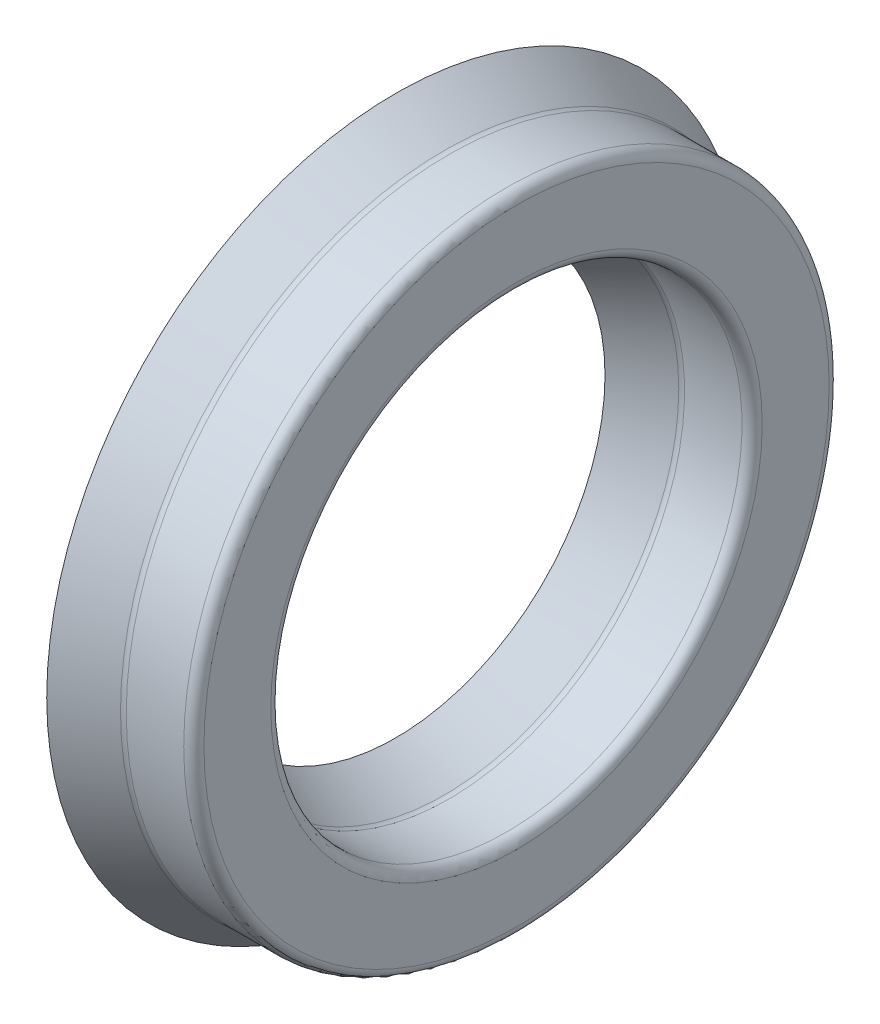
ISO-10303-21;
HEADER;
FILE_DESCRIPTION(('STEP AP214'),'2;1');
FILE_NAME('part.step','',(''),(''),'','','');
FILE_SCHEMA(('AUTOMOTIVE_DESIGN { 1 0 10303 214 1 1 1 1 }'));
ENDSEC;
DATA;
#1=APPLICATION_CONTEXT('core data for automotive mechanical design processes');
#2=APPLICATION_PROTOCOL_DEFINITION('international standard','automotive_design',2000,#1);
#3=PRODUCT_CONTEXT('',#1,'mechanical');
#4=PRODUCT('Part','Part','',(#3));
#5=PRODUCT_RELATED_PRODUCT_CATEGORY('part','',(#4));
#6=PRODUCT_DEFINITION_FORMATION('','',#4);
#7=PRODUCT_DEFINITION_CONTEXT('part definition',#1,'design');
#8=PRODUCT_DEFINITION('design','',#6,#7);
#9=PRODUCT_DEFINITION_SHAPE('','',#8);
#10=(LENGTH_UNIT() NAMED_UNIT(*) SI_UNIT(.MILLI.,.METRE.));
#11=(NAMED_UNIT(*) PLANE_ANGLE_UNIT() SI_UNIT($,.RADIAN.));
#12=(NAMED_UNIT(*) SI_UNIT($,.STERADIAN.) SOLID_ANGLE_UNIT());
#13=UNCERTAINTY_MEASURE_WITH_UNIT(LENGTH_MEASURE(1.E-05),#10,'distance_accuracy_value','');
#14=(GEOMETRIC_REPRESENTATION_CONTEXT(3) GLOBAL_UNCERTAINTY_ASSIGNED_CONTEXT((#13)) GLOBAL_UNIT_ASSIGNED_CONTEXT((#10,
#11,#12)) REPRESENTATION_CONTEXT('',''));
#15=CARTESIAN_POINT('',(0.,0.,0.));
#16=DIRECTION('',(0.,0.,1.));
#17=DIRECTION('',(1.,0.,0.));
#18=AXIS2_PLACEMENT_3D('',#15,#16,#17);
#19=CARTESIAN_POINT('',(-1.16179520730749,0.,0.));
#20=DIRECTION('',(1.,0.,0.));
#21=DIRECTION('',(0.,0.,-1.));
#22=AXIS2_PLACEMENT_3D('',#19,#20,#21);
#23=CONICAL_SURFACE('',#22,7.9375,1.09429676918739);
#24=CARTESIAN_POINT('',(-1.5875,0.,0.));
#25=DIRECTION('',(-1.,0.,0.));
#26=DIRECTION('',(0.,0.,1.));
#27=AXIS2_PLACEMENT_3D('',#24,#25,#26);
#28=CIRCLE('',#27,7.112762);
#29=CARTESIAN_POINT('',(-1.5875,0.,7.112762));
#30=VERTEX_POINT('',#29);
#31=EDGE_CURVE('E10',#30,#30,#28,.T.);
#32=ORIENTED_EDGE('',*,*,#31,.F.);
#33=EDGE_LOOP('',(#32));
#34=FACE_BOUND('',#33,.T.);
#35=CARTESIAN_POINT('',(-1.16179520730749,0.,0.));
#36=DIRECTION('',(-1.,0.,0.));
#37=DIRECTION('',(0.,0.,1.));
#38=AXIS2_PLACEMENT_3D('',#35,#36,#37);
#39=CIRCLE('',#38,7.9375);
#40=CARTESIAN_POINT('',(-1.16179520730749,0.,7.9375));
#41=VERTEX_POINT('',#40);
#42=EDGE_CURVE('E83',#41,#41,#39,.T.);
#43=ORIENTED_EDGE('',*,*,#42,.T.);
#44=EDGE_LOOP('',(#43));
#45=FACE_BOUND('',#44,.T.);
#46=ADVANCED_FACE('F37',(#34,#45),#23,.T.);
#47=CARTESIAN_POINT('',(-1.5875,0.,0.));
#48=DIRECTION('',(-1.,0.,0.));
#49=DIRECTION('',(0.,0.,1.));
#50=AXIS2_PLACEMENT_3D('',#47,#48,#49);
#51=CONICAL_SURFACE('',#50,7.112762,0.476499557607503);
#52=CARTESIAN_POINT('',(-0.505407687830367,0.,0.));
#53=DIRECTION('',(-1.,0.,0.));
#54=DIRECTION('',(0.,0.,1.));
#55=AXIS2_PLACEMENT_3D('',#52,#53,#54);
#56=CIRCLE('',#55,6.55421870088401);
#57=CARTESIAN_POINT('',(-0.505407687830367,0.,6.55421870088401));
#58=VERTEX_POINT('',#57);
#59=EDGE_CURVE('E43',#58,#58,#56,.T.);
#60=ORIENTED_EDGE('',*,*,#59,.F.);
#61=EDGE_LOOP('',(#60));
#62=FACE_BOUND('',#61,.T.);
#63=ORIENTED_EDGE('',*,*,#31,.T.);
#64=EDGE_LOOP('',(#63));
#65=FACE_BOUND('',#64,.T.);
#66=ADVANCED_FACE('F156',(#62,#65),#51,.F.);
#67=CARTESIAN_POINT('',(-0.610819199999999,0.,0.));
#68=DIRECTION('',(-1.,0.,0.));
#69=DIRECTION('',(0.,0.,1.));
#70=AXIS2_PLACEMENT_3D('',#67,#68,#69);
#71=TOROIDAL_SURFACE('',#70,6.35,0.2298192);
#72=CARTESIAN_POINT('',(-0.505407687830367,0.,0.));
#73=DIRECTION('',(-1.,0.,0.));
#74=DIRECTION('',(0.,0.,1.));
#75=AXIS2_PLACEMENT_3D('',#72,#73,#74);
#76=CIRCLE('',#75,6.14578129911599);
#77=CARTESIAN_POINT('',(-0.505407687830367,0.,6.14578129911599));
#78=VERTEX_POINT('',#77);
#79=EDGE_CURVE('E47',#78,#78,#76,.T.);
#80=ORIENTED_EDGE('',*,*,#79,.F.);
#81=EDGE_LOOP('',(#80));
#82=FACE_BOUND('',#81,.T.);
#83=ORIENTED_EDGE('',*,*,#59,.T.);
#84=EDGE_LOOP('',(#83));
#85=FACE_BOUND('',#84,.T.);
#86=ADVANCED_FACE('F151',(#82,#85),#71,.F.);
#87=CARTESIAN_POINT('',(-0.505407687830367,0.,0.));
#88=DIRECTION('',(1.,0.,0.));
#89=DIRECTION('',(0.,0.,-1.));
#90=AXIS2_PLACEMENT_3D('',#87,#88,#89);
#91=CONICAL_SURFACE('',#90,6.14578129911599,0.476499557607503);
#92=CARTESIAN_POINT('',(-1.5875,0.,0.));
#93=DIRECTION('',(-1.,0.,0.));
#94=DIRECTION('',(0.,0.,1.));
#95=AXIS2_PLACEMENT_3D('',#92,#93,#94);
#96=CIRCLE('',#95,5.587238);
#97=CARTESIAN_POINT('',(-1.5875,0.,5.587238));
#98=VERTEX_POINT('',#97);
#99=EDGE_CURVE('E51',#98,#98,#96,.T.);
#100=ORIENTED_EDGE('',*,*,#99,.F.);
#101=EDGE_LOOP('',(#100));
#102=FACE_BOUND('',#101,.T.);
#103=ORIENTED_EDGE('',*,*,#79,.T.);
#104=EDGE_LOOP('',(#103));
#105=FACE_BOUND('',#104,.T.);
#106=ADVANCED_FACE('F145',(#102,#105),#91,.T.);
#107=CARTESIAN_POINT('',(-1.5875,0.,0.));
#108=DIRECTION('',(-1.,0.,0.));
#109=DIRECTION('',(0.,0.,1.));
#110=AXIS2_PLACEMENT_3D('',#107,#108,#109);
#111=CONICAL_SURFACE('',#110,5.587238,1.09429676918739);
#112=CARTESIAN_POINT('',(-1.16179520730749,0.,0.));
#113=DIRECTION('',(-1.,0.,0.));
#114=DIRECTION('',(0.,0.,1.));
#115=AXIS2_PLACEMENT_3D('',#112,#113,#114);
#116=CIRCLE('',#115,4.7625);
#117=CARTESIAN_POINT('',(-1.16179520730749,0.,4.7625));
#118=VERTEX_POINT('',#117);
#119=EDGE_CURVE('E56',#118,#118,#116,.T.);
#120=ORIENTED_EDGE('',*,*,#119,.F.);
#121=EDGE_LOOP('',(#120));
#122=FACE_BOUND('',#121,.T.);
#123=ORIENTED_EDGE('',*,*,#99,.T.);
#124=EDGE_LOOP('',(#123));
#125=FACE_BOUND('',#124,.T.);
#126=ADVANCED_FACE('F139',(#122,#125),#111,.F.);
#127=CARTESIAN_POINT('',(-1.16179520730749,0.,0.));
#128=DIRECTION('',(1.,0.,0.));
#129=DIRECTION('',(0.,0.,-1.));
#130=AXIS2_PLACEMENT_3D('',#127,#128,#129);
#131=CONICAL_SURFACE('',#130,4.7625,0.476499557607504);
#132=CARTESIAN_POINT('',(-0.0549897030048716,0.,0.));
#133=DIRECTION('',(-1.,0.,0.));
#134=DIRECTION('',(0.,0.,1.));
#135=AXIS2_PLACEMENT_3D('',#132,#133,#134);
#136=CIRCLE('',#135,5.333799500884);
#137=CARTESIAN_POINT('',(-0.0549897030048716,0.,5.333799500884));
#138=VERTEX_POINT('',#137);
#139=EDGE_CURVE('E59',#138,#138,#136,.T.);
#140=ORIENTED_EDGE('',*,*,#139,.F.);
#141=EDGE_LOOP('',(#140));
#142=FACE_BOUND('',#141,.T.);
#143=ORIENTED_EDGE('',*,*,#119,.T.);
#144=EDGE_LOOP('',(#143));
#145=FACE_BOUND('',#144,.T.);
#146=ADVANCED_FACE('F133',(#142,#145),#131,.F.);
#147=CARTESIAN_POINT('',(0.0504218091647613,0.,0.));
#148=DIRECTION('',(-1.,0.,0.));
#149=DIRECTION('',(0.,0.,1.));
#150=AXIS2_PLACEMENT_3D('',#147,#148,#149);
#151=TOROIDAL_SURFACE('',#150,5.1295808,0.229819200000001);
#152=CARTESIAN_POINT('',(0.0504218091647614,0.,0.));
#153=DIRECTION('',(-1.,0.,0.));
#154=DIRECTION('',(0.,0.,1.));
#155=AXIS2_PLACEMENT_3D('',#152,#153,#154);
#156=CIRCLE('',#155,5.3594);
#157=CARTESIAN_POINT('',(0.0504218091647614,0.,5.3594));
#158=VERTEX_POINT('',#157);
#159=EDGE_CURVE('E62',#158,#158,#156,.T.);
#160=ORIENTED_EDGE('',*,*,#159,.F.);
#161=EDGE_LOOP('',(#160));
#162=FACE_BOUND('',#161,.T.);
#163=ORIENTED_EDGE('',*,*,#139,.T.);
#164=EDGE_LOOP('',(#163));
#165=FACE_BOUND('',#164,.T.);
#166=ADVANCED_FACE('F127',(#162,#165),#151,.F.);
#167=CARTESIAN_POINT('',(-1.5875,0.,0.));
#168=DIRECTION('',(-1.,0.,0.));
#169=DIRECTION('',(0.,0.,1.));
#170=AXIS2_PLACEMENT_3D('',#167,#168,#169);
#171=CYLINDRICAL_SURFACE('',#170,5.3594);
#172=CARTESIAN_POINT('',(1.3576808,0.,0.));
#173=DIRECTION('',(-1.,0.,0.));
#174=DIRECTION('',(0.,0.,1.));
#175=AXIS2_PLACEMENT_3D('',#172,#173,#174);
#176=CIRCLE('',#175,5.3594);
#177=CARTESIAN_POINT('',(1.3576808,0.,5.3594));
#178=VERTEX_POINT('',#177);
#179=EDGE_CURVE('E65',#178,#178,#176,.T.);
#180=ORIENTED_EDGE('',*,*,#179,.F.);
#181=EDGE_LOOP('',(#180));
#182=FACE_BOUND('',#181,.T.);
#183=ORIENTED_EDGE('',*,*,#159,.T.);
#184=EDGE_LOOP('',(#183));
#185=FACE_BOUND('',#184,.T.);
#186=ADVANCED_FACE('F121',(#182,#185),#171,.F.);
#187=CARTESIAN_POINT('',(1.3576808,0.,0.));
#188=DIRECTION('',(-1.,0.,0.));
#189=DIRECTION('',(0.,0.,1.));
#190=AXIS2_PLACEMENT_3D('',#187,#188,#189);
#191=TOROIDAL_SURFACE('',#190,5.5892192,0.229819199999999);
#192=CARTESIAN_POINT('',(1.5875,0.,0.));
#193=DIRECTION('',(-1.,0.,0.));
#194=DIRECTION('',(0.,0.,1.));
#195=AXIS2_PLACEMENT_3D('',#192,#193,#194);
#196=CIRCLE('',#195,5.5892192);
#197=CARTESIAN_POINT('',(1.5875,0.,5.5892192));
#198=VERTEX_POINT('',#197);
#199=EDGE_CURVE('E68',#198,#198,#196,.T.);
#200=ORIENTED_EDGE('',*,*,#199,.F.);
#201=EDGE_LOOP('',(#200));
#202=FACE_BOUND('',#201,.T.);
#203=ORIENTED_EDGE('',*,*,#179,.T.);
#204=EDGE_LOOP('',(#203));
#205=FACE_BOUND('',#204,.T.);
#206=ADVANCED_FACE('F115',(#202,#205),#191,.T.);
#207=CARTESIAN_POINT('',(1.5875,7.1107808,0.));
#208=DIRECTION('',(-1.,0.,0.));
#209=DIRECTION('',(0.,0.,1.));
#210=AXIS2_PLACEMENT_3D('',#207,#208,#209);
#211=PLANE('',#210);
#212=CARTESIAN_POINT('',(1.5875,0.,0.));
#213=DIRECTION('',(-1.,0.,0.));
#214=DIRECTION('',(0.,0.,1.));
#215=AXIS2_PLACEMENT_3D('',#212,#213,#214);
#216=CIRCLE('',#215,7.1107808);
#217=CARTESIAN_POINT('',(1.5875,0.,7.1107808));
#218=VERTEX_POINT('',#217);
#219=EDGE_CURVE('E71',#218,#218,#216,.T.);
#220=ORIENTED_EDGE('',*,*,#219,.F.);
#221=EDGE_LOOP('',(#220));
#222=FACE_BOUND('',#221,.T.);
#223=ORIENTED_EDGE('',*,*,#199,.T.);
#224=EDGE_LOOP('',(#223));
#225=FACE_BOUND('',#224,.T.);
#226=ADVANCED_FACE('F109',(#222,#225),#211,.F.);
#227=CARTESIAN_POINT('',(1.3576808,0.,0.));
#228=DIRECTION('',(-1.,0.,0.));
#229=DIRECTION('',(0.,0.,1.));
#230=AXIS2_PLACEMENT_3D('',#227,#228,#229);
#231=TOROIDAL_SURFACE('',#230,7.1107808,0.229819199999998);
#232=CARTESIAN_POINT('',(1.3576808,0.,0.));
#233=DIRECTION('',(-1.,0.,0.));
#234=DIRECTION('',(0.,0.,1.));
#235=AXIS2_PLACEMENT_3D('',#232,#233,#234);
#236=CIRCLE('',#235,7.3406);
#237=CARTESIAN_POINT('',(1.3576808,0.,7.3406));
#238=VERTEX_POINT('',#237);
#239=EDGE_CURVE('E74',#238,#238,#236,.T.);
#240=ORIENTED_EDGE('',*,*,#239,.F.);
#241=EDGE_LOOP('',(#240));
#242=FACE_BOUND('',#241,.T.);
#243=ORIENTED_EDGE('',*,*,#219,.T.);
#244=EDGE_LOOP('',(#243));
#245=FACE_BOUND('',#244,.T.);
#246=ADVANCED_FACE('F103',(#242,#245),#231,.T.);
#247=CARTESIAN_POINT('',(-1.5875,0.,0.));
#248=DIRECTION('',(-1.,0.,0.));
#249=DIRECTION('',(0.,0.,1.));
#250=AXIS2_PLACEMENT_3D('',#247,#248,#249);
#251=CYLINDRICAL_SURFACE('',#250,7.3406);
#252=CARTESIAN_POINT('',(0.0504218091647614,0.,0.));
#253=DIRECTION('',(-1.,0.,0.));
#254=DIRECTION('',(0.,0.,1.));
#255=AXIS2_PLACEMENT_3D('',#252,#253,#254);
#256=CIRCLE('',#255,7.3406);
#257=CARTESIAN_POINT('',(0.0504218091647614,0.,7.3406));
#258=VERTEX_POINT('',#257);
#259=EDGE_CURVE('E77',#258,#258,#256,.T.);
#260=ORIENTED_EDGE('',*,*,#259,.F.);
#261=EDGE_LOOP('',(#260));
#262=FACE_BOUND('',#261,.T.);
#263=ORIENTED_EDGE('',*,*,#239,.T.);
#264=EDGE_LOOP('',(#263));
#265=FACE_BOUND('',#264,.T.);
#266=ADVANCED_FACE('F97',(#262,#265),#251,.T.);
#267=CARTESIAN_POINT('',(0.0504218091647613,0.,0.));
#268=DIRECTION('',(-1.,0.,0.));
#269=DIRECTION('',(0.,0.,1.));
#270=AXIS2_PLACEMENT_3D('',#267,#268,#269);
#271=TOROIDAL_SURFACE('',#270,7.5704192,0.229819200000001);
#272=CARTESIAN_POINT('',(-0.054989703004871,0.,0.));
#273=DIRECTION('',(-1.,0.,0.));
#274=DIRECTION('',(0.,0.,1.));
#275=AXIS2_PLACEMENT_3D('',#272,#273,#274);
#276=CIRCLE('',#275,7.366200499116);
#277=CARTESIAN_POINT('',(-0.054989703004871,0.,7.366200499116));
#278=VERTEX_POINT('',#277);
#279=EDGE_CURVE('E80',#278,#278,#276,.T.);
#280=ORIENTED_EDGE('',*,*,#279,.F.);
#281=EDGE_LOOP('',(#280));
#282=FACE_BOUND('',#281,.T.);
#283=ORIENTED_EDGE('',*,*,#259,.T.);
#284=EDGE_LOOP('',(#283));
#285=FACE_BOUND('',#284,.T.);
#286=ADVANCED_FACE('F91',(#282,#285),#271,.F.);
#287=CARTESIAN_POINT('',(-0.054989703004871,0.,0.));
#288=DIRECTION('',(-1.,0.,0.));
#289=DIRECTION('',(0.,0.,1.));
#290=AXIS2_PLACEMENT_3D('',#287,#288,#289);
#291=CONICAL_SURFACE('',#290,7.366200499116,0.476499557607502);
#292=ORIENTED_EDGE('',*,*,#42,.F.);
#293=EDGE_LOOP('',(#292));
#294=FACE_BOUND('',#293,.T.);
#295=ORIENTED_EDGE('',*,*,#279,.T.);
#296=EDGE_LOOP('',(#295));
#297=FACE_BOUND('',#296,.T.);
#298=ADVANCED_FACE('F88',(#294,#297),#291,.T.);
#299=CLOSED_SHELL('',(#46,#66,#86,#106,#126,#146,#166,#186,#206,#226,#246,#266,#286,#298));
#300=MANIFOLD_SOLID_BREP('B2',#299);
#301=ADVANCED_BREP_SHAPE_REPRESENTATION('',(#18,#300),#14);
#302=SHAPE_DEFINITION_REPRESENTATION(#9,#301);
ENDSEC;
END-ISO-10303-21;
